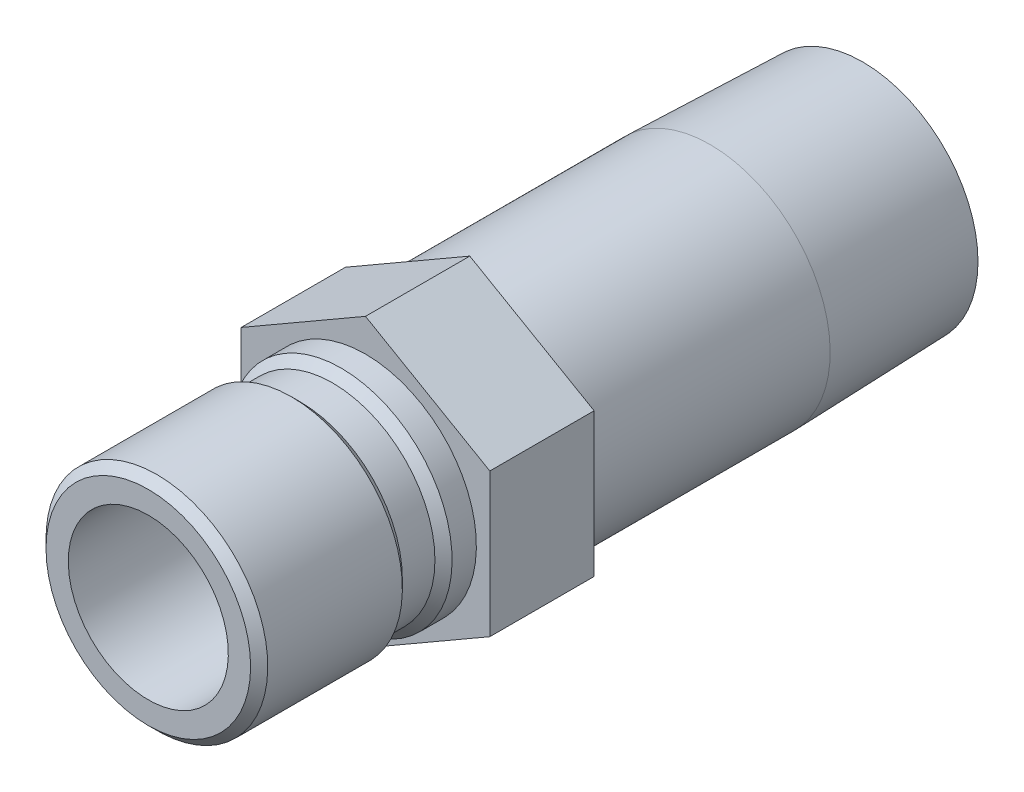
from build123d import *

# Parameters (mm, degrees)
SKETCH2_R           = 7.112
BOSS_EXTRUDE1_DEPTH = 9.271


with BuildPart() as part:
    # Sketch1 → Revolve1 (revolve)
    with BuildSketch(Plane(origin=(0, 0, 0), x_dir=(0, 0, -1), z_dir=(1, 0, 0))):
        Polygon((-19.304, 7.112), (-19.304, 9.0932), (-18.542, 9.8552), (-6.5786, 9.8552), (-5.8166, 9.0932), (-2.921, 9.0932), (-2.159, 9.8552), (0, 9.8552), (0, 10.668), (30.6324, 10.668), (44.196, 10.244140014), (44.196, 7.8994), (-1.105331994, 7.8994), (-1.524, 7.112), align=None)
    revolve(axis=Axis((0, 0, 0), (0, 0, 1)))

    # Sketch2 → Boss-Extrude1 (add)
    with BuildSketch(Plane.XY):
        Polygon((-11.049, 6.379143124), (-11.049, -6.379143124), (0, -12.758286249), (11.049, -6.379143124), (11.049, 6.379143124), (0, 12.758286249), align=None)
        with Locations(Location((0, 0, 0), (0, 0, 90))):
            Circle(SKETCH2_R, mode=Mode.SUBTRACT)
    extrude(amount=-BOSS_EXTRUDE1_DEPTH)


solid = part.part
